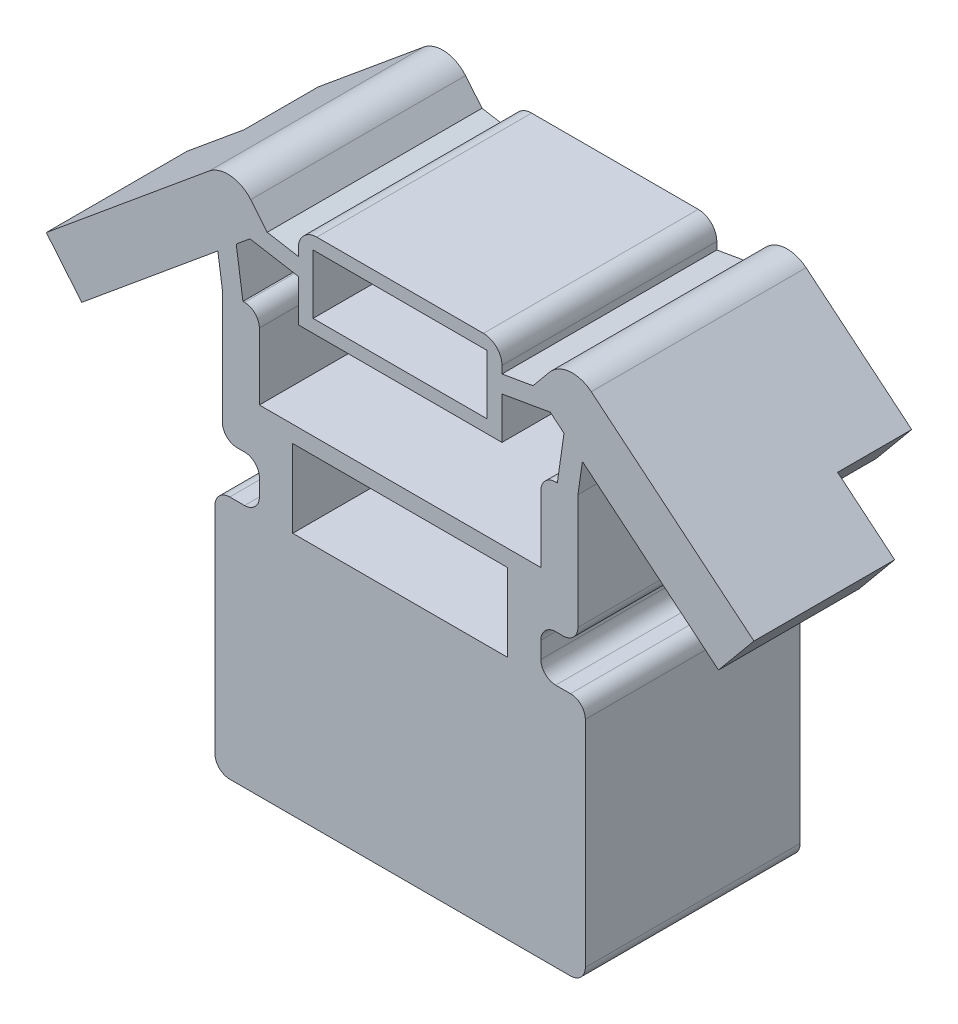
from build123d import *

# Parameters (mm, degrees)
EXTRUDE_1_DEPTH     = 5.8
SKETCH_10_W         = 5.8
SKETCH_10_H         = 2.1
SKETCH_10_W_2       = 4.7
SKETCH_10_H_2       = 1.6
CUT_EXTRUDE_3_DEPTH = 11.972528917
EXTRUDE_2_DEPTH     = 5.8
FILLET_1_R          = 0.5
SKETCH_12_W         = 5.8
SKETCH_12_H         = 0.1
SKETCH_12_W_2       = 7.6
EXTRUDE_3_DEPTH     = 5.8
SKETCH_14_W         = 5.8
SKETCH_14_H         = 0.1
CUT_EXTRUDE_4_DEPTH = 11.972528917
FILLET_2_R          = 0.4
SKETCH_18_W         = 8.8
SKETCH_18_H         = 4
EXTRUDE_6_DEPTH     = 5.8
SKETCH_19_W         = 8.8
SKETCH_19_H         = 4
EXTRUDE_7_DEPTH     = 0.4
FILLET_3_R          = 0.8
FILLET_5_R          = 0.4
FILLET_6_R          = 0.1
EXTRUDE_8_DEPTH     = 5.8
SKETCH_23_W         = 5
SKETCH_23_H         = 1.4
CUT_EXTRUDE_5_DEPTH = 5.4
FILLET_8_R          = 0.4
CUT_EXTRUDE_6_DEPTH = 2


with BuildPart() as part:
    # Sketch 1 → Extrude 1 (new body)
    with BuildSketch(Plane.XY):
        Polygon((2.75, 5.4), (3.587596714, 5.544678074), (4.543777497, 6.700410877), (6.469998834, 5.106776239), (5.513818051, 3.951043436), (4.921234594, 4.441309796), (4.8, 3.6), (4.8, 0.1), (3.8, 0.1), (3.8, -1.4), (-3.8, -1.4), (-3.8, 1.4), (3.8, 1.4), (3.8, 3.6), (4.244318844, 3.6), (4.42474543, 4.852073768), (4.054377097, 5.158493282), (2.75, 4.933188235), (2.75, 3.8), (-2.75, 3.8), (-2.75, 5.4), align=None)
    extrude_1 = extrude(amount=EXTRUDE_1_DEPTH)

    # Mirror 1: Extrude 1 across plane
    add(extrude_1.mirror(Plane(origin=(0, 0, 0), x_dir=(0, 0, 1), z_dir=(1, 0, 0))))

    # Sketch 10 → Cut-Extrude 3 (cut, through all)
    with BuildSketch(Plane.XY.offset(5.8)):
        Rectangle(SKETCH_10_W, SKETCH_10_H)
        with Locations((0, 4.95)):
            Rectangle(SKETCH_10_W_2, SKETCH_10_H_2)
    extrude(amount=-CUT_EXTRUDE_3_DEPTH, mode=Mode.SUBTRACT)

    # Sketch 11 → Extrude 2 (add)
    with BuildSketch(Plane.XY.offset(5.8)):
        Polygon((-2.35, 5.4), (-2.75, 5.4), (-2.75, 6.1), (2.75, 6.1), (2.75, 5.4), (2.35, 5.4), (2.35, 5.75), (-2.35, 5.75), align=None)
    extrude(amount=-EXTRUDE_2_DEPTH)

    # Fillet 1
    fillet_1_edges = [part.edges().sort_by_distance(p)[0] for p in [
        (2.75, 6.1, 2.9),
        (-2.75, 6.1, 2.9),
    ]]
    fillet(fillet_1_edges, radius=FILLET_1_R)

    # Sketch 12 → Extrude 3 (add)
    with BuildSketch(Plane.XY.offset(5.8)):
        with Locations((0, 1)):
            Rectangle(SKETCH_12_W, SKETCH_12_H)
        with Locations((0, -1.45)):
            Rectangle(SKETCH_12_W_2, SKETCH_12_H)
    extrude(amount=-EXTRUDE_3_DEPTH)

    # Sketch 14 → Cut-Extrude 4 (cut, through all)
    with BuildSketch(Plane.XY.offset(5.8)):
        with Locations((0, -1.1)):
            Rectangle(SKETCH_14_W, SKETCH_14_H)
    extrude(amount=-CUT_EXTRUDE_4_DEPTH, mode=Mode.SUBTRACT)

    # Fillet 2
    fillet_2_edges = [part.edges().sort_by_distance(p)[0] for p in [
        (3.8, 3.6, 2.9),
        (-3.8, 3.6, 2.9),
    ]]
    fillet(fillet_2_edges, radius=FILLET_2_R)

    # Sketch 18 → Extrude 6 (add)
    with BuildSketch(Plane.XY.offset(5.8)):
        Polygon((-5, -1.15), (-5, -7.75), (5, -7.75), (5, -1.15), (3.8, -1.15), (3.8, -1.5), (-3.8, -1.5), (-3.8, -1.15), align=None)
        with Locations((0, -5.15)):
            Rectangle(SKETCH_18_W, SKETCH_18_H, mode=Mode.SUBTRACT)
    extrude(amount=-EXTRUDE_6_DEPTH)

    # Sketch 19 → Extrude 7 (add)
    with BuildSketch(Plane.XY.offset(5.8)):
        with Locations((0, -5.15)):
            Rectangle(SKETCH_19_W, SKETCH_19_H)
    extrude(amount=-EXTRUDE_7_DEPTH)

    # Fillet 3
    fillet_3_edges = [part.edges().sort_by_distance(p)[0] for p in [
        (4.543777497, 6.700410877, 2.9),
        (-4.543777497, 6.700410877, 2.9),
    ]]
    fillet(fillet_3_edges, radius=FILLET_3_R)

    # Fillet 5
    fillet_5_edges = [part.edges().sort_by_distance(p)[0] for p in [
        (-3.8, -1.15, 2.9),
        (3.8, -1.15, 2.9),
        (5, -1.15, 2.9),
        (5, -7.75, 2.9),
        (-5, -7.75, 2.9),
        (-5, -1.15, 2.9),
        (4.8, 0.1, 2.9),
        (3.8, 0.1, 2.9),
        (-4.8, 0.1, 2.9),
        (-3.8, 0.1, 2.9),
    ]]
    fillet(fillet_5_edges, radius=FILLET_5_R)

    # Fillet 6
    fillet_6_edges = [part.edges().sort_by_distance(p)[0] for p in [
        (-4.4, -3.15, 2.7),
        (4.4, -3.15, 2.7),
        (4.4, -7.15, 2.7),
        (-4.4, -7.15, 2.7),
    ]]
    fillet(fillet_6_edges, radius=FILLET_6_R)

    # Sketch 20 → Extrude 8 (add)
    with BuildSketch(Plane(origin=(0, 0, 0), x_dir=(-1, 0, 0), z_dir=(0, 0, -1))):
        Polygon((-5.513818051, 3.951043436), (-8.595772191, 1.401228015), (-9.551952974, 2.556960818), (-6.469998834, 5.106776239), align=None)
    extrude_8 = extrude(amount=-EXTRUDE_8_DEPTH)

    # Mirror 2: Extrude 8 across plane
    add(extrude_8.mirror(Plane(origin=(0, 0, 0), x_dir=(0, 0, 1), z_dir=(1, 0, 0))))

    # Sketch 23 → Cut-Extrude 5 (cut)
    with BuildSketch(Plane(origin=(0, 0, 0), x_dir=(-1, 0, 0), z_dir=(0, 0, -1))):
        with Locations((0, -2.45)):
            Rectangle(SKETCH_23_W, SKETCH_23_H)
    extrude(amount=-CUT_EXTRUDE_5_DEPTH, mode=Mode.SUBTRACT)

    # Fillet 8
    fillet_8_edges = [part.edges().sort_by_distance(p)[0] for p in [
        (-2.5, -3.15, 2.7),
        (-2.5, -1.75, 2.7),
        (2.5, -1.75, 2.7),
        (2.5, -3.15, 2.7),
    ]]
    fillet(fillet_8_edges, radius=FILLET_8_R)

    # Sketch 24 → Cut-Extrude 6 (cut)
    with BuildSketch(Plane(origin=(0, 0, 0), x_dir=(-1, 0, 0), z_dir=(0, 0, -1))):
        Polygon((8.595772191, 1.401228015), (9.551952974, 2.556960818), (8.010975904, 3.831868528), (7.054795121, 2.676135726), align=None)
    cut_extrude_6 = extrude(amount=-CUT_EXTRUDE_6_DEPTH, mode=Mode.SUBTRACT)

    # Mirror 3: Cut-Extrude 6 across plane
    add(cut_extrude_6.mirror(Plane(origin=(0, 0, 0), x_dir=(0, 0, 1), z_dir=(1, 0, 0))), mode=Mode.SUBTRACT)


solid = part.part
